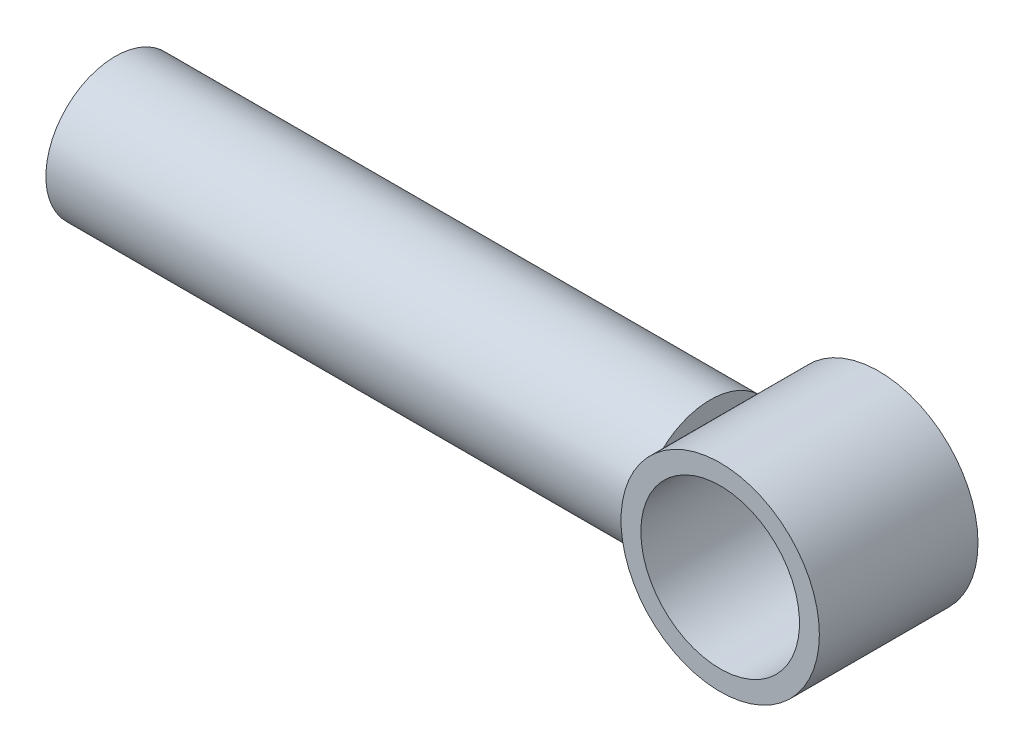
ISO-10303-21;
HEADER;
FILE_DESCRIPTION(('STEP AP214'),'2;1');
FILE_NAME('part.step','',(''),(''),'','','');
FILE_SCHEMA(('AUTOMOTIVE_DESIGN { 1 0 10303 214 1 1 1 1 }'));
ENDSEC;
DATA;
#1=APPLICATION_CONTEXT('core data for automotive mechanical design processes');
#2=APPLICATION_PROTOCOL_DEFINITION('international standard','automotive_design',2000,#1);
#3=PRODUCT_CONTEXT('',#1,'mechanical');
#4=PRODUCT('Part','Part','',(#3));
#5=PRODUCT_RELATED_PRODUCT_CATEGORY('part','',(#4));
#6=PRODUCT_DEFINITION_FORMATION('','',#4);
#7=PRODUCT_DEFINITION_CONTEXT('part definition',#1,'design');
#8=PRODUCT_DEFINITION('design','',#6,#7);
#9=PRODUCT_DEFINITION_SHAPE('','',#8);
#10=(LENGTH_UNIT() NAMED_UNIT(*) SI_UNIT(.MILLI.,.METRE.));
#11=(NAMED_UNIT(*) PLANE_ANGLE_UNIT() SI_UNIT($,.RADIAN.));
#12=(NAMED_UNIT(*) SI_UNIT($,.STERADIAN.) SOLID_ANGLE_UNIT());
#13=UNCERTAINTY_MEASURE_WITH_UNIT(LENGTH_MEASURE(1.E-05),#10,'distance_accuracy_value','');
#14=(GEOMETRIC_REPRESENTATION_CONTEXT(3) GLOBAL_UNCERTAINTY_ASSIGNED_CONTEXT((#13)) GLOBAL_UNIT_ASSIGNED_CONTEXT((#10,
#11,#12)) REPRESENTATION_CONTEXT('',''));
#15=CARTESIAN_POINT('',(0.,0.,0.));
#16=DIRECTION('',(0.,0.,1.));
#17=DIRECTION('',(1.,0.,0.));
#18=AXIS2_PLACEMENT_3D('',#15,#16,#17);
#19=CARTESIAN_POINT('',(0.,0.,50.8));
#20=DIRECTION('',(0.,0.,0.999999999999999));
#21=DIRECTION('',(0.999999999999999,0.,0.));
#22=AXIS2_PLACEMENT_3D('',#19,#20,#21);
#23=PLANE('',#22);
#24=CARTESIAN_POINT('',(0.,0.,50.8));
#25=DIRECTION('',(0.,0.,0.999999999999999));
#26=DIRECTION('',(0.999999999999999,0.,0.));
#27=AXIS2_PLACEMENT_3D('',#24,#25,#26);
#28=CIRCLE('',#27,63.5);
#29=CARTESIAN_POINT('',(63.4999999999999,0.,50.8));
#30=VERTEX_POINT('',#29);
#31=EDGE_CURVE('E383',#30,#30,#28,.T.);
#32=ORIENTED_EDGE('',*,*,#31,.T.);
#33=EDGE_LOOP('',(#32));
#34=FACE_BOUND('',#33,.T.);
#35=CARTESIAN_POINT('',(0.,0.,50.8));
#36=DIRECTION('',(0.,0.,0.999999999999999));
#37=DIRECTION('',(0.999999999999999,0.,0.));
#38=AXIS2_PLACEMENT_3D('',#35,#36,#37);
#39=CIRCLE('',#38,50.8);
#40=CARTESIAN_POINT('',(-50.7999999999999,0.,50.8));
#41=VERTEX_POINT('',#40);
#42=EDGE_CURVE('E424',#41,#41,#39,.T.);
#43=ORIENTED_EDGE('',*,*,#42,.F.);
#44=EDGE_LOOP('',(#43));
#45=FACE_BOUND('',#44,.T.);
#46=ADVANCED_FACE('F350',(#34,#45),#23,.T.);
#47=CARTESIAN_POINT('',(0.,0.,50.8));
#48=DIRECTION('',(0.,0.,-0.999999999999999));
#49=DIRECTION('',(-0.999999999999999,0.,0.));
#50=AXIS2_PLACEMENT_3D('',#47,#48,#49);
#51=CYLINDRICAL_SURFACE('',#50,63.5);
#52=CARTESIAN_POINT('',(-57.15,27.6790082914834,34.7803824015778));
#53=CARTESIAN_POINT('',(-57.3608962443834,27.2435633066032,35.1269111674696));
#54=CARTESIAN_POINT('',(-57.5691546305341,26.8008738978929,35.4658636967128));
#55=CARTESIAN_POINT('',(-57.9795220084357,25.901150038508,36.1281770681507));
#56=CARTESIAN_POINT('',(-58.1816304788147,25.4441143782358,36.4515365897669));
#57=CARTESIAN_POINT('',(-58.7776050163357,24.051260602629,37.3978580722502));
#58=CARTESIAN_POINT('',(-59.1608656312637,23.0942173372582,37.9966470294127));
#59=CARTESIAN_POINT('',(-59.8938910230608,21.1207683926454,39.1282198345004));
#60=CARTESIAN_POINT('',(-60.243430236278,20.1040275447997,39.6605653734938));
#61=CARTESIAN_POINT('',(-60.8989795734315,18.0209845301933,40.6494181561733));
#62=CARTESIAN_POINT('',(-61.2050000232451,16.9546942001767,41.1059433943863));
#63=CARTESIAN_POINT('',(-61.7682326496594,14.7720150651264,41.9399834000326));
#64=CARTESIAN_POINT('',(-62.0251710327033,13.6553858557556,42.3170560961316));
#65=CARTESIAN_POINT('',(-62.4818378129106,11.3846770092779,42.9836194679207));
#66=CARTESIAN_POINT('',(-62.6815623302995,10.2305948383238,43.2731042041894));
#67=CARTESIAN_POINT('',(-63.0179242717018,7.89781057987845,43.7589067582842));
#68=CARTESIAN_POINT('',(-63.1547614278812,6.71919904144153,43.9555195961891));
#69=CARTESIAN_POINT('',(-63.3624283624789,4.34428538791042,44.2533762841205));
#70=CARTESIAN_POINT('',(-63.4332671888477,3.14798572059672,44.3546332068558));
#71=CARTESIAN_POINT('',(-63.5030389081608,0.875702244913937,44.4543520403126));
#72=CARTESIAN_POINT('',(-63.5087686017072,-0.199661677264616,44.4625306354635));
#73=CARTESIAN_POINT('',(-63.4656951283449,-2.34701468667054,44.4009851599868));
#74=CARTESIAN_POINT('',(-63.416895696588,-3.41900400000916,44.3312664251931));
#75=CARTESIAN_POINT('',(-63.2658562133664,-5.55208119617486,44.1149298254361));
#76=CARTESIAN_POINT('',(-63.163580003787,-6.61316120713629,43.968259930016));
#77=CARTESIAN_POINT('',(-62.9078997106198,-8.71596148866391,43.600159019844));
#78=CARTESIAN_POINT('',(-62.7544958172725,-9.75768183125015,43.3787282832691));
#79=CARTESIAN_POINT('',(-62.4062122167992,-11.7783000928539,42.8733029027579));
#80=CARTESIAN_POINT('',(-62.212999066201,-12.7581152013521,42.5918095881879));
#81=CARTESIAN_POINT('',(-61.7858152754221,-14.6880874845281,41.9653660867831));
#82=CARTESIAN_POINT('',(-61.5518436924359,-15.6382439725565,41.6204144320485));
#83=CARTESIAN_POINT('',(-61.047305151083,-17.5046089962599,40.8705626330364));
#84=CARTESIAN_POINT('',(-60.7767336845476,-18.42081333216,40.4656551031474));
#85=CARTESIAN_POINT('',(-60.2035377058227,-20.2156194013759,39.5995437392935));
#86=CARTESIAN_POINT('',(-59.90091852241,-21.0942273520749,39.1383492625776));
#87=CARTESIAN_POINT('',(-59.397852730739,-22.4596823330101,38.3628121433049));
#88=CARTESIAN_POINT('',(-59.2062854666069,-22.9596828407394,38.0656282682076));
#89=CARTESIAN_POINT('',(-58.8146170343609,-23.9451844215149,37.4535310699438));
#90=CARTESIAN_POINT('',(-58.6145172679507,-24.4306878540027,37.1386206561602));
#91=CARTESIAN_POINT('',(-58.207386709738,-25.3854014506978,36.4926719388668));
#92=CARTESIAN_POINT('',(-58.0003790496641,-25.85465700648,36.1616860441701));
#93=CARTESIAN_POINT('',(-57.5798335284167,-26.7781698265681,35.4832407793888));
#94=CARTESIAN_POINT('',(-57.3662950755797,-27.2324257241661,35.1357799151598));
#95=CARTESIAN_POINT('',(-57.1499999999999,-27.6790082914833,34.780382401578));
#96=B_SPLINE_CURVE_WITH_KNOTS('',3,(#52,#53,#54,#55,#56,#57,#58,#59,#60,#61,#62,#63,#64,#65,#66,
#67,#68,#69,#70,#71,#72,#73,#74,#75,#76,#77,#78,#79,#80,#81,#82,#83,#84,#85,#86,#87,#88,#89,#90,
#91,#92,#93,#94,#95),.UNSPECIFIED.,.F.,.F.,(4,2,2,2,2,2,2,2,2,2,2,2,2,2,2,2,2,2,2,2,2,4),(0.,
1.78517101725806,3.57049295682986,7.1432736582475,10.7385002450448,14.3328723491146,
17.9467440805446,21.5608608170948,25.1634183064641,28.765481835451,31.9875796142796,
35.2094566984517,38.433515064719,41.6575614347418,44.7671025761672,47.8767156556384,
50.9867121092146,54.0961922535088,55.9329226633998,57.7693524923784,59.6001517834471,
61.431117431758),.UNSPECIFIED.);
#97=CARTESIAN_POINT('',(-57.15,27.6790082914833,34.7803824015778));
#98=VERTEX_POINT('',#97);
#99=CARTESIAN_POINT('',(-57.1499999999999,-27.6790082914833,34.780382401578));
#100=VERTEX_POINT('',#99);
#101=EDGE_CURVE('E382',#98,#100,#96,.T.);
#102=ORIENTED_EDGE('',*,*,#101,.T.);
#103=DIRECTION('',(0.,0.,-0.999999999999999));
#104=VECTOR('',#103,1.);
#105=CARTESIAN_POINT('',(-57.1499999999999,-27.6790082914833,50.8));
#106=LINE('',#105,#104);
#107=CARTESIAN_POINT('',(-57.1499999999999,-27.6790082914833,-34.780382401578));
#108=VERTEX_POINT('',#107);
#109=EDGE_CURVE('E11',#100,#108,#106,.T.);
#110=ORIENTED_EDGE('',*,*,#109,.T.);
#111=CARTESIAN_POINT('',(-57.1499999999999,-27.6790082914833,-34.780382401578));
#112=CARTESIAN_POINT('',(-57.3608962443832,-27.2435633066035,-35.1269111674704));
#113=CARTESIAN_POINT('',(-57.5691546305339,-26.8008738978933,-35.4658636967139));
#114=CARTESIAN_POINT('',(-57.9795220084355,-25.9011500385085,-36.128177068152));
#115=CARTESIAN_POINT('',(-58.1816304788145,-25.4441143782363,-36.4515365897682));
#116=CARTESIAN_POINT('',(-58.7776050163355,-24.0512606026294,-37.3978580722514));
#117=CARTESIAN_POINT('',(-59.1608656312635,-23.0942173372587,-37.9966470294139));
#118=CARTESIAN_POINT('',(-59.8938910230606,-21.1207683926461,-39.1282198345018));
#119=CARTESIAN_POINT('',(-60.2434302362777,-20.1040275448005,-39.6605653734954));
#120=CARTESIAN_POINT('',(-60.8989795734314,-18.0209845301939,-40.6494181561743));
#121=CARTESIAN_POINT('',(-61.2050000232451,-16.9546942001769,-41.1059433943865));
#122=CARTESIAN_POINT('',(-61.7682326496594,-14.7720150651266,-41.9399834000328));
#123=CARTESIAN_POINT('',(-62.0251710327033,-13.655385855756,-42.3170560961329));
#124=CARTESIAN_POINT('',(-62.4818378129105,-11.3846770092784,-42.9836194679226));
#125=CARTESIAN_POINT('',(-62.6815623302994,-10.2305948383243,-43.273104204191));
#126=CARTESIAN_POINT('',(-63.0179242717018,-7.89781057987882,-43.7589067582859));
#127=CARTESIAN_POINT('',(-63.1547614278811,-6.71919904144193,-43.9555195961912));
#128=CARTESIAN_POINT('',(-63.3624283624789,-4.34428538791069,-44.2533762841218));
#129=CARTESIAN_POINT('',(-63.4332671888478,-3.14798572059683,-44.3546332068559));
#130=CARTESIAN_POINT('',(-63.5030389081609,-0.875702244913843,-44.4543520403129));
#131=CARTESIAN_POINT('',(-63.5087686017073,0.199661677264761,-44.462530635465));
#132=CARTESIAN_POINT('',(-63.4656951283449,2.34701468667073,-44.400985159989));
#133=CARTESIAN_POINT('',(-63.416895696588,3.41900400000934,-44.3312664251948));
#134=CARTESIAN_POINT('',(-63.2658562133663,5.5520811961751,-44.1149298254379));
#135=CARTESIAN_POINT('',(-63.163580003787,6.6131612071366,-43.9682599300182));
#136=CARTESIAN_POINT('',(-62.9078997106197,8.71596148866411,-43.6001590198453));
#137=CARTESIAN_POINT('',(-62.7544958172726,9.75768183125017,-43.3787282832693));
#138=CARTESIAN_POINT('',(-62.4062122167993,11.7783000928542,-42.8733029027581));
#139=CARTESIAN_POINT('',(-62.2129990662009,12.7581152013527,-42.5918095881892));
#140=CARTESIAN_POINT('',(-61.7858152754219,14.6880874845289,-41.9653660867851));
#141=CARTESIAN_POINT('',(-61.5518436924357,15.6382439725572,-41.6204144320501));
#142=CARTESIAN_POINT('',(-61.0473051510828,17.5046089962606,-40.870562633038));
#143=CARTESIAN_POINT('',(-60.7767336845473,18.4208133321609,-40.4656551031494));
#144=CARTESIAN_POINT('',(-60.2035377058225,20.2156194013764,-39.5995437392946));
#145=CARTESIAN_POINT('',(-59.9009185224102,21.0942273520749,-39.1383492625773));
#146=CARTESIAN_POINT('',(-59.3978527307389,22.4596823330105,-38.3628121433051));
#147=CARTESIAN_POINT('',(-59.2062854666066,22.9596828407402,-38.0656282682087));
#148=CARTESIAN_POINT('',(-58.8146170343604,23.945184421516,-37.4535310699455));
#149=CARTESIAN_POINT('',(-58.6145172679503,24.4306878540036,-37.1386206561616));
#150=CARTESIAN_POINT('',(-58.2073867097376,25.3854014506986,-36.4926719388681));
#151=CARTESIAN_POINT('',(-58.0003790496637,25.8546570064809,-36.1616860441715));
#152=CARTESIAN_POINT('',(-57.5798335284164,26.7781698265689,-35.4832407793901));
#153=CARTESIAN_POINT('',(-57.3662950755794,27.2324257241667,-35.1357799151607));
#154=CARTESIAN_POINT('',(-57.15,27.6790082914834,-34.780382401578));
#155=B_SPLINE_CURVE_WITH_KNOTS('',3,(#111,#112,#113,#114,#115,#116,#117,#118,#119,#120,#121,
#122,#123,#124,#125,#126,#127,#128,#129,#130,#131,#132,#133,#134,#135,#136,#137,#138,#139,#140,
#141,#142,#143,#144,#145,#146,#147,#148,#149,#150,#151,#152,#153,#154),.UNSPECIFIED.,.F.,.F.,(4,
2,2,2,2,2,2,2,2,2,2,2,2,2,2,2,2,2,2,2,2,4),(0.,1.78517101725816,3.57049295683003,
7.14327365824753,10.7385002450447,14.3328723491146,17.9467440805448,21.5608608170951,
25.1634183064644,28.7654818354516,31.9875796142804,35.2094566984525,38.4335150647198,
41.6575614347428,44.7671025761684,47.8767156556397,50.9867121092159,54.0961922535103,
55.9329226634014,57.76935249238,59.6001517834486,61.4311174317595),.UNSPECIFIED.);
#156=CARTESIAN_POINT('',(-57.15,27.6790082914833,-34.780382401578));
#157=VERTEX_POINT('',#156);
#158=EDGE_CURVE('E359',#108,#157,#155,.T.);
#159=ORIENTED_EDGE('',*,*,#158,.T.);
#160=DIRECTION('',(0.,0.,-0.999999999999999));
#161=VECTOR('',#160,1.);
#162=CARTESIAN_POINT('',(-57.15,27.6790082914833,50.7999999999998));
#163=LINE('',#162,#161);
#164=EDGE_CURVE('E378',#157,#98,#163,.F.);
#165=ORIENTED_EDGE('',*,*,#164,.T.);
#166=EDGE_LOOP('',(#102,#110,#159,#165));
#167=FACE_BOUND('',#166,.T.);
#168=ORIENTED_EDGE('',*,*,#31,.F.);
#169=EDGE_LOOP('',(#168));
#170=FACE_BOUND('',#169,.T.);
#171=CARTESIAN_POINT('',(0.,0.,-50.8));
#172=DIRECTION('',(0.,0.,0.999999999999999));
#173=DIRECTION('',(0.999999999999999,0.,0.));
#174=AXIS2_PLACEMENT_3D('',#171,#172,#173);
#175=CIRCLE('',#174,63.5);
#176=CARTESIAN_POINT('',(63.4999999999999,0.,-50.8));
#177=VERTEX_POINT('',#176);
#178=EDGE_CURVE('E425',#177,#177,#175,.T.);
#179=ORIENTED_EDGE('',*,*,#178,.T.);
#180=EDGE_LOOP('',(#179));
#181=FACE_BOUND('',#180,.T.);
#182=ADVANCED_FACE('F352',(#167,#170,#181),#51,.T.);
#183=CARTESIAN_POINT('',(0.,0.,50.8));
#184=DIRECTION('',(0.,0.,-0.999999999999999));
#185=DIRECTION('',(-0.999999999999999,0.,0.));
#186=AXIS2_PLACEMENT_3D('',#183,#184,#185);
#187=CYLINDRICAL_SURFACE('',#186,50.8);
#188=CARTESIAN_POINT('',(0.,0.,-50.8));
#189=DIRECTION('',(0.,0.,0.999999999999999));
#190=DIRECTION('',(0.999999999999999,0.,0.));
#191=AXIS2_PLACEMENT_3D('',#188,#189,#190);
#192=CIRCLE('',#191,50.8);
#193=CARTESIAN_POINT('',(-50.7999999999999,0.,-50.8));
#194=VERTEX_POINT('',#193);
#195=EDGE_CURVE('E429',#194,#194,#192,.T.);
#196=CARTESIAN_POINT('',(-50.7999999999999,0.,50.8));
#197=CARTESIAN_POINT('',(-50.7999999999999,0.,49.7416666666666));
#198=CARTESIAN_POINT('',(-50.7999999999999,0.,48.6833333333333));
#199=CARTESIAN_POINT('',(-50.7999999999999,0.,46.5666666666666));
#200=CARTESIAN_POINT('',(-50.7999999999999,0.,45.5083333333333));
#201=CARTESIAN_POINT('',(-50.7999999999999,0.,43.3916666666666));
#202=CARTESIAN_POINT('',(-50.7999999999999,0.,42.3333333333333));
#203=CARTESIAN_POINT('',(-50.7999999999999,0.,40.2166666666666));
#204=CARTESIAN_POINT('',(-50.7999999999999,0.,39.1583333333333));
#205=CARTESIAN_POINT('',(-50.7999999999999,0.,37.0416666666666));
#206=CARTESIAN_POINT('',(-50.7999999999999,0.,35.9833333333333));
#207=CARTESIAN_POINT('',(-50.7999999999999,0.,33.8666666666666));
#208=CARTESIAN_POINT('',(-50.7999999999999,0.,32.8083333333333));
#209=CARTESIAN_POINT('',(-50.7999999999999,0.,30.6916666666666));
#210=CARTESIAN_POINT('',(-50.7999999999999,0.,29.6333333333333));
#211=CARTESIAN_POINT('',(-50.7999999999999,0.,27.5166666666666));
#212=CARTESIAN_POINT('',(-50.7999999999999,0.,26.4583333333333));
#213=CARTESIAN_POINT('',(-50.7999999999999,0.,24.3416666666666));
#214=CARTESIAN_POINT('',(-50.7999999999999,0.,23.2833333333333));
#215=CARTESIAN_POINT('',(-50.7999999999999,0.,21.1666666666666));
#216=CARTESIAN_POINT('',(-50.7999999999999,0.,20.1083333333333));
#217=CARTESIAN_POINT('',(-50.7999999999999,0.,17.9916666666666));
#218=CARTESIAN_POINT('',(-50.7999999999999,0.,16.9333333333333));
#219=CARTESIAN_POINT('',(-50.7999999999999,0.,14.8166666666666));
#220=CARTESIAN_POINT('',(-50.7999999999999,0.,13.7583333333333));
#221=CARTESIAN_POINT('',(-50.7999999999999,0.,11.6416666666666));
#222=CARTESIAN_POINT('',(-50.7999999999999,0.,10.5833333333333));
#223=CARTESIAN_POINT('',(-50.7999999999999,0.,8.46666666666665));
#224=CARTESIAN_POINT('',(-50.7999999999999,0.,7.40833333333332));
#225=CARTESIAN_POINT('',(-50.7999999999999,0.,5.29166666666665));
#226=CARTESIAN_POINT('',(-50.7999999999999,0.,4.23333333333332));
#227=CARTESIAN_POINT('',(-50.7999999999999,0.,2.11666666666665));
#228=CARTESIAN_POINT('',(-50.7999999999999,0.,1.05833333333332));
#229=CARTESIAN_POINT('',(-50.7999999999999,0.,-1.05833333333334));
#230=CARTESIAN_POINT('',(-50.7999999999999,0.,-2.11666666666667));
#231=CARTESIAN_POINT('',(-50.7999999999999,0.,-4.23333333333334));
#232=CARTESIAN_POINT('',(-50.7999999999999,0.,-5.29166666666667));
#233=CARTESIAN_POINT('',(-50.7999999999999,0.,-7.40833333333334));
#234=CARTESIAN_POINT('',(-50.7999999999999,0.,-8.46666666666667));
#235=CARTESIAN_POINT('',(-50.7999999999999,0.,-10.5833333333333));
#236=CARTESIAN_POINT('',(-50.7999999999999,0.,-11.6416666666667));
#237=CARTESIAN_POINT('',(-50.7999999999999,0.,-13.7583333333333));
#238=CARTESIAN_POINT('',(-50.7999999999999,0.,-14.8166666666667));
#239=CARTESIAN_POINT('',(-50.7999999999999,0.,-16.9333333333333));
#240=CARTESIAN_POINT('',(-50.7999999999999,0.,-17.9916666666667));
#241=CARTESIAN_POINT('',(-50.7999999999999,0.,-20.1083333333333));
#242=CARTESIAN_POINT('',(-50.7999999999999,0.,-21.1666666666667));
#243=CARTESIAN_POINT('',(-50.7999999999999,0.,-23.2833333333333));
#244=CARTESIAN_POINT('',(-50.7999999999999,0.,-24.3416666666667));
#245=CARTESIAN_POINT('',(-50.7999999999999,0.,-26.4583333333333));
#246=CARTESIAN_POINT('',(-50.7999999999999,0.,-27.5166666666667));
#247=CARTESIAN_POINT('',(-50.7999999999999,0.,-29.6333333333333));
#248=CARTESIAN_POINT('',(-50.7999999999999,0.,-30.6916666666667));
#249=CARTESIAN_POINT('',(-50.7999999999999,0.,-32.8083333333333));
#250=CARTESIAN_POINT('',(-50.7999999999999,0.,-33.8666666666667));
#251=CARTESIAN_POINT('',(-50.7999999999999,0.,-35.9833333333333));
#252=CARTESIAN_POINT('',(-50.7999999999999,0.,-37.0416666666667));
#253=CARTESIAN_POINT('',(-50.7999999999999,0.,-39.1583333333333));
#254=CARTESIAN_POINT('',(-50.7999999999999,0.,-40.2166666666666));
#255=CARTESIAN_POINT('',(-50.7999999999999,0.,-42.3333333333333));
#256=CARTESIAN_POINT('',(-50.7999999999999,0.,-43.3916666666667));
#257=CARTESIAN_POINT('',(-50.7999999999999,0.,-45.5083333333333));
#258=CARTESIAN_POINT('',(-50.7999999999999,0.,-46.5666666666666));
#259=CARTESIAN_POINT('',(-50.7999999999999,0.,-48.6833333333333));
#260=CARTESIAN_POINT('',(-50.7999999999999,0.,-49.7416666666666));
#261=CARTESIAN_POINT('',(-50.7999999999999,0.,-50.8));
#262=B_SPLINE_CURVE_WITH_KNOTS('',3,(#196,#197,#198,#199,#200,#201,#202,#203,#204,#205,#206,
#207,#208,#209,#210,#211,#212,#213,#214,#215,#216,#217,#218,#219,#220,#221,#222,#223,#224,#225,
#226,#227,#228,#229,#230,#231,#232,#233,#234,#235,#236,#237,#238,#239,#240,#241,#242,#243,#244,
#245,#246,#247,#248,#249,#250,#251,#252,#253,#254,#255,#256,#257,#258,#259,#260,#261),
.UNSPECIFIED.,.F.,.F.,(4,2,2,2,2,2,2,2,2,2,2,2,2,2,2,2,2,2,2,2,2,2,2,2,2,2,2,2,2,2,2,2,4),(0.,
3.175,6.35,9.525,12.7,15.875,19.05,22.225,25.4,28.575,31.75,34.925,38.1,41.275,44.45,47.625,
50.8,53.975,57.15,60.325,63.5,66.675,69.85,73.0249999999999,76.1999999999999,79.3749999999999,
82.5499999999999,85.725,88.8999999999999,92.0749999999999,95.2499999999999,98.4249999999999,
101.6),.UNSPECIFIED.);
#263=EDGE_CURVE('BSEAM410',#41,#194,#262,.T.);
#264=ORIENTED_EDGE('',*,*,#42,.T.);
#265=ORIENTED_EDGE('',*,*,#195,.F.);
#266=ORIENTED_EDGE('',*,*,#263,.T.);
#267=ORIENTED_EDGE('',*,*,#263,.F.);
#268=EDGE_LOOP('',(#264,#266,#265,#267));
#269=FACE_BOUND('',#268,.T.);
#270=ADVANCED_FACE('F410',(#269),#187,.F.);
#271=CARTESIAN_POINT('',(0.,0.,-50.8));
#272=DIRECTION('',(0.,0.,0.999999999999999));
#273=DIRECTION('',(0.999999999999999,0.,0.));
#274=AXIS2_PLACEMENT_3D('',#271,#272,#273);
#275=PLANE('',#274);
#276=ORIENTED_EDGE('',*,*,#195,.T.);
#277=EDGE_LOOP('',(#276));
#278=FACE_BOUND('',#277,.T.);
#279=ORIENTED_EDGE('',*,*,#178,.F.);
#280=EDGE_LOOP('',(#279));
#281=FACE_BOUND('',#280,.T.);
#282=ADVANCED_FACE('F403',(#278,#281),#275,.F.);
#283=CARTESIAN_POINT('',(-438.149999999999,2.22044604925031E-13,-8.88178419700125E-13));
#284=DIRECTION('',(0.999999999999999,0.,0.));
#285=DIRECTION('',(0.,0.,-0.999999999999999));
#286=AXIS2_PLACEMENT_3D('',#283,#284,#285);
#287=CYLINDRICAL_SURFACE('',#286,44.45);
#288=CARTESIAN_POINT('',(-438.149999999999,2.22044604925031E-13,-8.88178419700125E-13));
#289=DIRECTION('',(0.999999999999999,0.,0.));
#290=DIRECTION('',(0.,0.,-0.999999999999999));
#291=AXIS2_PLACEMENT_3D('',#288,#289,#290);
#292=CIRCLE('',#291,44.45);
#293=CARTESIAN_POINT('',(-438.149999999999,2.22044604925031E-13,-44.4500000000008));
#294=VERTEX_POINT('',#293);
#295=EDGE_CURVE('E386',#294,#294,#292,.T.);
#296=ORIENTED_EDGE('',*,*,#295,.T.);
#297=EDGE_LOOP('',(#296));
#298=FACE_BOUND('',#297,.T.);
#299=ORIENTED_EDGE('',*,*,#158,.F.);
#300=CARTESIAN_POINT('',(-57.1499999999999,0.,-1.94289029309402E-13));
#301=DIRECTION('',(0.999999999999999,0.,0.));
#302=DIRECTION('',(0.,0.,-0.999999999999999));
#303=AXIS2_PLACEMENT_3D('',#300,#301,#302);
#304=CIRCLE('',#303,44.45);
#305=EDGE_CURVE('E387',#100,#108,#304,.T.);
#306=ORIENTED_EDGE('',*,*,#305,.F.);
#307=ORIENTED_EDGE('',*,*,#101,.F.);
#308=EDGE_CURVE('E365',#157,#98,#304,.T.);
#309=ORIENTED_EDGE('',*,*,#308,.F.);
#310=EDGE_LOOP('',(#299,#306,#307,#309));
#311=FACE_BOUND('',#310,.T.);
#312=ADVANCED_FACE('F385',(#298,#311),#287,.T.);
#313=CARTESIAN_POINT('',(-57.1499999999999,0.,-1.94289029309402E-13));
#314=DIRECTION('',(0.999999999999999,0.,0.));
#315=DIRECTION('',(0.,0.,-0.999999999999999));
#316=AXIS2_PLACEMENT_3D('',#313,#314,#315);
#317=PLANE('',#316);
#318=ORIENTED_EDGE('',*,*,#109,.F.);
#319=ORIENTED_EDGE('',*,*,#305,.T.);
#320=EDGE_LOOP('',(#318,#319));
#321=FACE_BOUND('',#320,.T.);
#322=ADVANCED_FACE('F402',(#321),#317,.T.);
#323=ORIENTED_EDGE('',*,*,#164,.F.);
#324=ORIENTED_EDGE('',*,*,#308,.T.);
#325=EDGE_LOOP('',(#323,#324));
#326=FACE_BOUND('',#325,.T.);
#327=ADVANCED_FACE('F379',(#326),#317,.T.);
#328=CARTESIAN_POINT('',(-438.149999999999,2.22044604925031E-13,-8.88178419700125E-13));
#329=DIRECTION('',(0.999999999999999,0.,0.));
#330=DIRECTION('',(0.,0.,-0.999999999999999));
#331=AXIS2_PLACEMENT_3D('',#328,#329,#330);
#332=PLANE('',#331);
#333=ORIENTED_EDGE('',*,*,#295,.F.);
#334=EDGE_LOOP('',(#333));
#335=FACE_BOUND('',#334,.T.);
#336=ADVANCED_FACE('F405',(#335),#332,.F.);
#337=CLOSED_SHELL('',(#46,#182,#270,#282,#312,#322,#327,#336));
#338=MANIFOLD_SOLID_BREP('B2',#337);
#339=ADVANCED_BREP_SHAPE_REPRESENTATION('',(#18,#338),#14);
#340=SHAPE_DEFINITION_REPRESENTATION(#9,#339);
ENDSEC;
END-ISO-10303-21;
